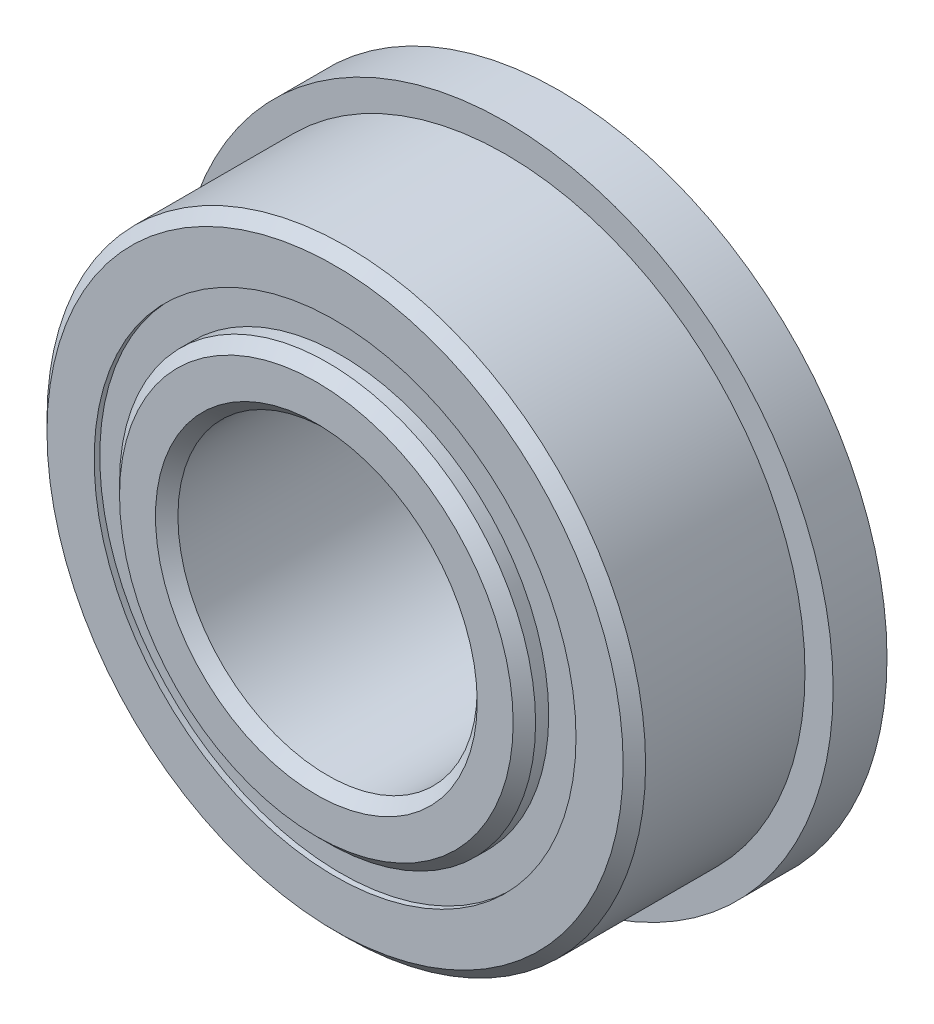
from build123d import *

# Parameters (mm, degrees)
CIRPATTERN1_COUNT = 12
SKETCH5_W         = 1.147826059
SKETCH5_H         = 0.697802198
SKETCH6_W         = 1.143
SKETCH6_H         = 1.835498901


with BuildPart() as part:
    # Sketch1 → Revolve1 (revolve)
    with BuildSketch(Plane(origin=(0, 0, 0), x_dir=(0, 0, -1), z_dir=(1, 0, 0)), mode=Mode.PRIVATE) as revolve1_sk:
        with BuildLine():
            Line((2.143125, 6.35), (-2.143125, 6.35))
            Line((-2.143125, 6.35), (-2.38125, 6.111875))
            Line((-2.38125, 6.111875), (-2.38125, 5.111401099))
            Line((-2.38125, 5.111401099), (-1.058333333, 5.111401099))
            ThreePointArc((-1.058333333, 5.111401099), (0, 5.876861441), (1.058333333, 5.111401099))
            Line((1.058333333, 5.111401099), (2.38125, 5.111401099))
            Line((2.38125, 5.111401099), (2.38125, 6.111875))
            Line((2.38125, 6.111875), (2.143125, 6.35))
        make_face()
    revolve(revolve1_sk.sketch.rotate(Axis((0, 0, 2.38125), (0, 0, -1)), 90), axis=Axis((0, 0, 2.38125), (0, 0, -1)))

    # Sketch6 → Revolve6 (revolve)
    with BuildSketch(Plane(origin=(0, 0, 0), x_dir=(0, 0, -1), z_dir=(1, 0, 0)), mode=Mode.PRIVATE) as revolve6_sk:
        with Locations((1.80975, 6.02915055)):
            Rectangle(SKETCH6_W, SKETCH6_H)
    revolve(revolve6_sk.sketch.rotate(Axis((0, 0, -2.38125), (0, 0, 1)), 270), axis=Axis((0, 0, -2.38125), (0, 0, 1)))


with BuildPart() as body_2:
    # Sketch3 → Revolve3 (revolve)
    with BuildSketch(Plane(origin=(0, 0, 0), x_dir=(0, 0, -1), z_dir=(1, 0, 0)), mode=Mode.PRIVATE) as revolve3_sk:
        with BuildLine():
            Line((-2.77876, 3.413125), (-2.77876, 4.175473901))
            Line((-2.77876, 4.175473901), (-2.540635, 4.413598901))
            Line((-2.540635, 4.413598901), (-1.058333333, 4.413598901))
            ThreePointArc((-1.058333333, 4.413598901), (0, 3.648138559), (1.058333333, 4.413598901))
            Line((1.058333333, 4.413598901), (2.540635, 4.413598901))
            Line((2.540635, 4.413598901), (2.77876, 4.175473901))
            Line((2.77876, 4.175473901), (2.77876, 3.413125))
            Line((2.77876, 3.413125), (2.540635, 3.175))
            Line((2.540635, 3.175), (-2.540635, 3.175))
            Line((-2.540635, 3.175), (-2.77876, 3.413125))
        make_face()
    revolve(revolve3_sk.sketch.rotate(Axis((0, 0, 2.38125), (0, 0, -1)), 90), axis=Axis((0, 0, 2.38125), (0, 0, -1)))


with BuildPart() as body_3:
    # Sketch4 → Revolve4 (revolve)
    with BuildSketch(Plane(origin=(0, 0, 0), x_dir=(0, 0, -1), z_dir=(1, 0, 0))):
        with BuildLine():
            Line((-1.114361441, 4.7625), (1.114361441, 4.7625))
            ThreePointArc((1.114361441, 4.7625), (0, 5.876861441), (-1.114361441, 4.7625))
        make_face()
    revolve(axis=Axis((0, 4.7625, 1.114361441), (0, 0, -1)))


with BuildPart() as cirpattern1_1:
    # CirPattern1: pattern copy
    add(body_3.part.rotate(Axis((0, 0, 0), (0, 0, 1)), 1 * 360 / CIRPATTERN1_COUNT))


with BuildPart() as cirpattern1_2:
    # CirPattern1: pattern copy
    add(body_3.part.rotate(Axis((0, 0, 0), (0, 0, 1)), 2 * 360 / CIRPATTERN1_COUNT))


with BuildPart() as cirpattern1_3:
    # CirPattern1: pattern copy
    add(body_3.part.rotate(Axis((0, 0, 0), (0, 0, 1)), 3 * 360 / CIRPATTERN1_COUNT))


with BuildPart() as cirpattern1_4:
    # CirPattern1: pattern copy
    add(body_3.part.rotate(Axis((0, 0, 0), (0, 0, 1)), 4 * 360 / CIRPATTERN1_COUNT))


with BuildPart() as cirpattern1_5:
    # CirPattern1: pattern copy
    add(body_3.part.rotate(Axis((0, 0, 0), (0, 0, 1)), 5 * 360 / CIRPATTERN1_COUNT))


with BuildPart() as cirpattern1_6:
    # CirPattern1: pattern copy
    add(body_3.part.rotate(Axis((0, 0, 0), (0, 0, 1)), 6 * 360 / CIRPATTERN1_COUNT))


with BuildPart() as cirpattern1_7:
    # CirPattern1: pattern copy
    add(body_3.part.rotate(Axis((0, 0, 0), (0, 0, 1)), 7 * 360 / CIRPATTERN1_COUNT))


with BuildPart() as cirpattern1_8:
    # CirPattern1: pattern copy
    add(body_3.part.rotate(Axis((0, 0, 0), (0, 0, 1)), 8 * 360 / CIRPATTERN1_COUNT))


with BuildPart() as cirpattern1_9:
    # CirPattern1: pattern copy
    add(body_3.part.rotate(Axis((0, 0, 0), (0, 0, 1)), 9 * 360 / CIRPATTERN1_COUNT))


with BuildPart() as cirpattern1_10:
    # CirPattern1: pattern copy
    add(body_3.part.rotate(Axis((0, 0, 0), (0, 0, 1)), 10 * 360 / CIRPATTERN1_COUNT))


with BuildPart() as cirpattern1_11:
    # CirPattern1: pattern copy
    add(body_3.part.rotate(Axis((0, 0, 0), (0, 0, 1)), 11 * 360 / CIRPATTERN1_COUNT))


with BuildPart() as body_15:
    # Sketch5 → Revolve5 (revolve)
    with BuildSketch(Plane(origin=(0, 0, 0), x_dir=(0, 0, -1), z_dir=(1, 0, 0)), mode=Mode.PRIVATE) as revolve5_sk:
        with Locations((-1.688274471, 4.7625)):
            Rectangle(SKETCH5_W, SKETCH5_H)
        with Locations((1.688274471, 4.7625)):
            Rectangle(SKETCH5_W, SKETCH5_H)
    revolve(revolve5_sk.sketch.rotate(Axis((0, 0, 2.38125), (0, 0, -1)), 90), axis=Axis((0, 0, 2.38125), (0, 0, -1)))


solid = Compound([part.part, body_2.part, body_3.part, cirpattern1_1.part, cirpattern1_2.part, cirpattern1_3.part, cirpattern1_4.part, cirpattern1_5.part, cirpattern1_6.part, cirpattern1_7.part, cirpattern1_8.part, cirpattern1_9.part, cirpattern1_10.part, cirpattern1_11.part, body_15.part])
